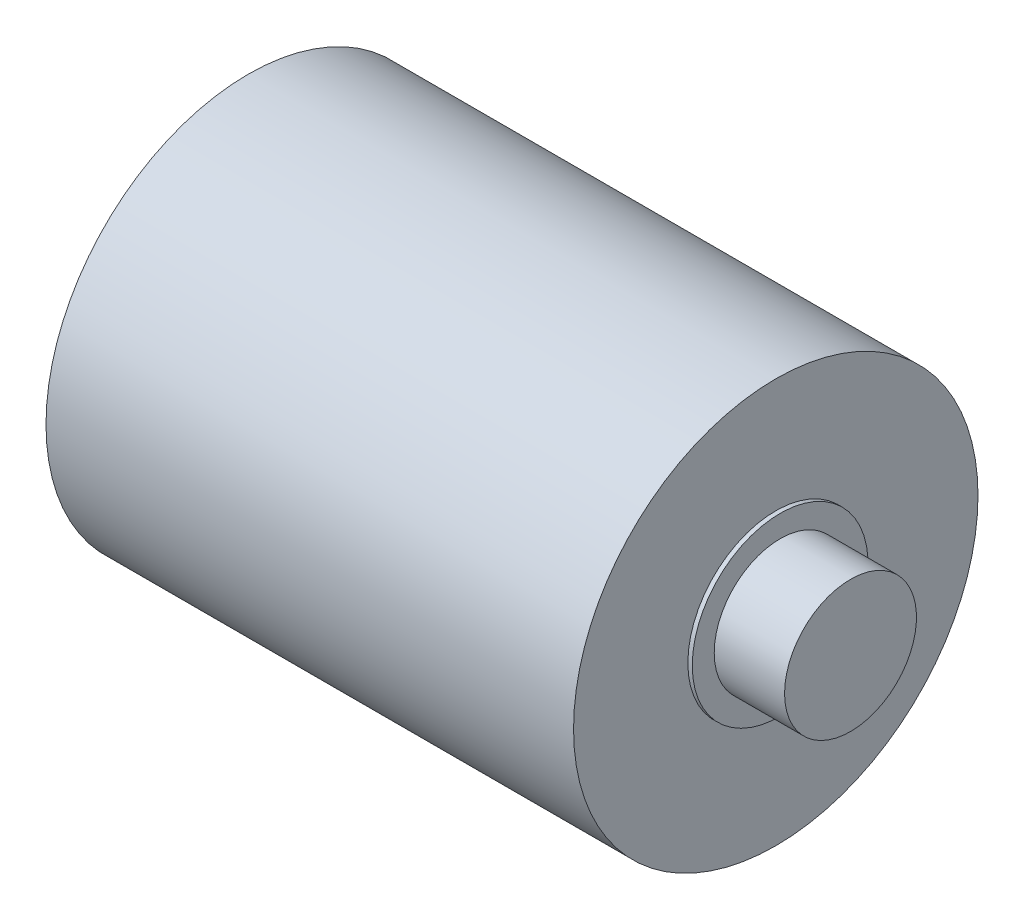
ISO-10303-21;
HEADER;
FILE_DESCRIPTION(('STEP AP214'),'2;1');
FILE_NAME('part.step','',(''),(''),'','','');
FILE_SCHEMA(('AUTOMOTIVE_DESIGN { 1 0 10303 214 1 1 1 1 }'));
ENDSEC;
DATA;
#1=APPLICATION_CONTEXT('core data for automotive mechanical design processes');
#2=APPLICATION_PROTOCOL_DEFINITION('international standard','automotive_design',2000,#1);
#3=PRODUCT_CONTEXT('',#1,'mechanical');
#4=PRODUCT('Part','Part','',(#3));
#5=PRODUCT_RELATED_PRODUCT_CATEGORY('part','',(#4));
#6=PRODUCT_DEFINITION_FORMATION('','',#4);
#7=PRODUCT_DEFINITION_CONTEXT('part definition',#1,'design');
#8=PRODUCT_DEFINITION('design','',#6,#7);
#9=PRODUCT_DEFINITION_SHAPE('','',#8);
#10=(LENGTH_UNIT() NAMED_UNIT(*) SI_UNIT(.MILLI.,.METRE.));
#11=(NAMED_UNIT(*) PLANE_ANGLE_UNIT() SI_UNIT($,.RADIAN.));
#12=(NAMED_UNIT(*) SI_UNIT($,.STERADIAN.) SOLID_ANGLE_UNIT());
#13=UNCERTAINTY_MEASURE_WITH_UNIT(LENGTH_MEASURE(1.E-05),#10,'distance_accuracy_value','');
#14=(GEOMETRIC_REPRESENTATION_CONTEXT(3) GLOBAL_UNCERTAINTY_ASSIGNED_CONTEXT((#13)) GLOBAL_UNIT_ASSIGNED_CONTEXT((#10,
#11,#12)) REPRESENTATION_CONTEXT('',''));
#15=CARTESIAN_POINT('',(0.,0.,0.));
#16=DIRECTION('',(0.,0.,1.));
#17=DIRECTION('',(1.,0.,0.));
#18=AXIS2_PLACEMENT_3D('',#15,#16,#17);
#19=CARTESIAN_POINT('',(68.5,0.,0.));
#20=DIRECTION('',(1.,0.,0.));
#21=DIRECTION('',(0.,0.,-1.));
#22=AXIS2_PLACEMENT_3D('',#19,#20,#21);
#23=PLANE('',#22);
#24=CARTESIAN_POINT('',(68.5,0.,0.));
#25=DIRECTION('',(-1.,0.,0.));
#26=DIRECTION('',(0.,0.,1.));
#27=AXIS2_PLACEMENT_3D('',#24,#25,#26);
#28=CIRCLE('',#27,7.5);
#29=CARTESIAN_POINT('',(68.5,0.,7.5));
#30=VERTEX_POINT('',#29);
#31=EDGE_CURVE('E18',#30,#30,#28,.T.);
#32=ORIENTED_EDGE('',*,*,#31,.F.);
#33=EDGE_LOOP('',(#32));
#34=FACE_BOUND('',#33,.T.);
#35=ADVANCED_FACE('F15',(#34),#23,.T.);
#36=CARTESIAN_POINT('',(-8.5,0.,0.));
#37=DIRECTION('',(-1.,0.,0.));
#38=DIRECTION('',(0.,0.,1.));
#39=AXIS2_PLACEMENT_3D('',#36,#37,#38);
#40=PLANE('',#39);
#41=CARTESIAN_POINT('',(-8.5,0.,0.));
#42=DIRECTION('',(1.,0.,0.));
#43=DIRECTION('',(0.,0.,-1.));
#44=AXIS2_PLACEMENT_3D('',#41,#42,#43);
#45=CIRCLE('',#44,7.5);
#46=CARTESIAN_POINT('',(-8.5,0.,-7.5));
#47=VERTEX_POINT('',#46);
#48=EDGE_CURVE('E46',#47,#47,#45,.T.);
#49=ORIENTED_EDGE('',*,*,#48,.F.);
#50=EDGE_LOOP('',(#49));
#51=FACE_BOUND('',#50,.T.);
#52=ADVANCED_FACE('F56',(#51),#40,.T.);
#53=CARTESIAN_POINT('',(68.5,0.,0.));
#54=DIRECTION('',(-1.,0.,0.));
#55=DIRECTION('',(0.,0.,1.));
#56=AXIS2_PLACEMENT_3D('',#53,#54,#55);
#57=CYLINDRICAL_SURFACE('',#56,7.5);
#58=CARTESIAN_POINT('',(60.5,0.,0.));
#59=DIRECTION('',(-1.,0.,0.));
#60=DIRECTION('',(0.,0.,1.));
#61=AXIS2_PLACEMENT_3D('',#58,#59,#60);
#62=CIRCLE('',#61,7.5);
#63=CARTESIAN_POINT('',(60.5,0.,7.5));
#64=VERTEX_POINT('',#63);
#65=EDGE_CURVE('E44',#64,#64,#62,.T.);
#66=ORIENTED_EDGE('',*,*,#65,.F.);
#67=EDGE_LOOP('',(#66));
#68=FACE_BOUND('',#67,.T.);
#69=ORIENTED_EDGE('',*,*,#31,.T.);
#70=EDGE_LOOP('',(#69));
#71=FACE_BOUND('',#70,.T.);
#72=ADVANCED_FACE('F53',(#68,#71),#57,.T.);
#73=CARTESIAN_POINT('',(-8.5,0.,0.));
#74=DIRECTION('',(1.,0.,0.));
#75=DIRECTION('',(0.,0.,-1.));
#76=AXIS2_PLACEMENT_3D('',#73,#74,#75);
#77=CYLINDRICAL_SURFACE('',#76,7.5);
#78=CARTESIAN_POINT('',(-0.5,0.,0.));
#79=DIRECTION('',(1.,0.,0.));
#80=DIRECTION('',(0.,0.,-1.));
#81=AXIS2_PLACEMENT_3D('',#78,#79,#80);
#82=CIRCLE('',#81,7.5);
#83=CARTESIAN_POINT('',(-0.5,0.,-7.5));
#84=VERTEX_POINT('',#83);
#85=EDGE_CURVE('E41',#84,#84,#82,.T.);
#86=ORIENTED_EDGE('',*,*,#85,.F.);
#87=EDGE_LOOP('',(#86));
#88=FACE_BOUND('',#87,.T.);
#89=ORIENTED_EDGE('',*,*,#48,.T.);
#90=EDGE_LOOP('',(#89));
#91=FACE_BOUND('',#90,.T.);
#92=ADVANCED_FACE('F92',(#88,#91),#77,.T.);
#93=CARTESIAN_POINT('',(60.5,0.,0.));
#94=DIRECTION('',(1.,0.,0.));
#95=DIRECTION('',(0.,0.,-1.));
#96=AXIS2_PLACEMENT_3D('',#93,#94,#95);
#97=PLANE('',#96);
#98=ORIENTED_EDGE('',*,*,#65,.T.);
#99=EDGE_LOOP('',(#98));
#100=FACE_BOUND('',#99,.T.);
#101=CARTESIAN_POINT('',(60.5,0.,0.));
#102=DIRECTION('',(-1.,0.,0.));
#103=DIRECTION('',(0.,0.,1.));
#104=AXIS2_PLACEMENT_3D('',#101,#102,#103);
#105=CIRCLE('',#104,10.);
#106=CARTESIAN_POINT('',(60.5,0.,10.));
#107=VERTEX_POINT('',#106);
#108=EDGE_CURVE('E38',#107,#107,#105,.T.);
#109=ORIENTED_EDGE('',*,*,#108,.F.);
#110=EDGE_LOOP('',(#109));
#111=FACE_BOUND('',#110,.T.);
#112=ADVANCED_FACE('F88',(#100,#111),#97,.T.);
#113=CARTESIAN_POINT('',(-0.5,0.,0.));
#114=DIRECTION('',(-1.,0.,0.));
#115=DIRECTION('',(0.,0.,1.));
#116=AXIS2_PLACEMENT_3D('',#113,#114,#115);
#117=PLANE('',#116);
#118=ORIENTED_EDGE('',*,*,#85,.T.);
#119=EDGE_LOOP('',(#118));
#120=FACE_BOUND('',#119,.T.);
#121=CARTESIAN_POINT('',(-0.5,0.,0.));
#122=DIRECTION('',(1.,0.,0.));
#123=DIRECTION('',(0.,0.,-1.));
#124=AXIS2_PLACEMENT_3D('',#121,#122,#123);
#125=CIRCLE('',#124,10.);
#126=CARTESIAN_POINT('',(-0.5,0.,-10.));
#127=VERTEX_POINT('',#126);
#128=EDGE_CURVE('E35',#127,#127,#125,.T.);
#129=ORIENTED_EDGE('',*,*,#128,.F.);
#130=EDGE_LOOP('',(#129));
#131=FACE_BOUND('',#130,.T.);
#132=ADVANCED_FACE('F84',(#120,#131),#117,.T.);
#133=CARTESIAN_POINT('',(60.5,0.,0.));
#134=DIRECTION('',(-1.,0.,0.));
#135=DIRECTION('',(0.,0.,1.));
#136=AXIS2_PLACEMENT_3D('',#133,#134,#135);
#137=CYLINDRICAL_SURFACE('',#136,10.);
#138=CARTESIAN_POINT('',(60.,0.,0.));
#139=DIRECTION('',(-1.,0.,0.));
#140=DIRECTION('',(0.,0.,1.));
#141=AXIS2_PLACEMENT_3D('',#138,#139,#140);
#142=CIRCLE('',#141,10.);
#143=CARTESIAN_POINT('',(60.,0.,10.));
#144=VERTEX_POINT('',#143);
#145=EDGE_CURVE('E32',#144,#144,#142,.T.);
#146=ORIENTED_EDGE('',*,*,#145,.F.);
#147=EDGE_LOOP('',(#146));
#148=FACE_BOUND('',#147,.T.);
#149=ORIENTED_EDGE('',*,*,#108,.T.);
#150=EDGE_LOOP('',(#149));
#151=FACE_BOUND('',#150,.T.);
#152=ADVANCED_FACE('F80',(#148,#151),#137,.T.);
#153=CARTESIAN_POINT('',(-0.5,0.,0.));
#154=DIRECTION('',(1.,0.,0.));
#155=DIRECTION('',(0.,0.,-1.));
#156=AXIS2_PLACEMENT_3D('',#153,#154,#155);
#157=CYLINDRICAL_SURFACE('',#156,10.);
#158=ORIENTED_EDGE('',*,*,#128,.T.);
#159=EDGE_LOOP('',(#158));
#160=FACE_BOUND('',#159,.T.);
#161=CARTESIAN_POINT('',(0.,0.,0.));
#162=DIRECTION('',(1.,0.,0.));
#163=DIRECTION('',(0.,0.,-1.));
#164=AXIS2_PLACEMENT_3D('',#161,#162,#163);
#165=CIRCLE('',#164,10.);
#166=CARTESIAN_POINT('',(0.,0.,-10.));
#167=VERTEX_POINT('',#166);
#168=EDGE_CURVE('E27',#167,#167,#165,.F.);
#169=ORIENTED_EDGE('',*,*,#168,.T.);
#170=EDGE_LOOP('',(#169));
#171=FACE_BOUND('',#170,.T.);
#172=ADVANCED_FACE('F76',(#160,#171),#157,.T.);
#173=CARTESIAN_POINT('',(60.,0.,0.));
#174=DIRECTION('',(1.,0.,0.));
#175=DIRECTION('',(0.,0.,-1.));
#176=AXIS2_PLACEMENT_3D('',#173,#174,#175);
#177=PLANE('',#176);
#178=ORIENTED_EDGE('',*,*,#145,.T.);
#179=EDGE_LOOP('',(#178));
#180=FACE_BOUND('',#179,.T.);
#181=CARTESIAN_POINT('',(60.,0.,0.));
#182=DIRECTION('',(-1.,0.,0.));
#183=DIRECTION('',(0.,0.,1.));
#184=AXIS2_PLACEMENT_3D('',#181,#182,#183);
#185=CIRCLE('',#184,23.);
#186=CARTESIAN_POINT('',(60.,0.,23.));
#187=VERTEX_POINT('',#186);
#188=EDGE_CURVE('E22',#187,#187,#185,.T.);
#189=ORIENTED_EDGE('',*,*,#188,.F.);
#190=EDGE_LOOP('',(#189));
#191=FACE_BOUND('',#190,.T.);
#192=ADVANCED_FACE('F69',(#180,#191),#177,.T.);
#193=CARTESIAN_POINT('',(0.,0.,0.));
#194=DIRECTION('',(1.,0.,0.));
#195=DIRECTION('',(0.,0.,-1.));
#196=AXIS2_PLACEMENT_3D('',#193,#194,#195);
#197=PLANE('',#196);
#198=ORIENTED_EDGE('',*,*,#168,.F.);
#199=EDGE_LOOP('',(#198));
#200=FACE_BOUND('',#199,.T.);
#201=CARTESIAN_POINT('',(0.,0.,0.));
#202=DIRECTION('',(-1.,0.,0.));
#203=DIRECTION('',(0.,0.,1.));
#204=AXIS2_PLACEMENT_3D('',#201,#202,#203);
#205=CIRCLE('',#204,23.);
#206=CARTESIAN_POINT('',(0.,0.,23.));
#207=VERTEX_POINT('',#206);
#208=EDGE_CURVE('E10',#207,#207,#205,.F.);
#209=ORIENTED_EDGE('',*,*,#208,.F.);
#210=EDGE_LOOP('',(#209));
#211=FACE_BOUND('',#210,.T.);
#212=ADVANCED_FACE('F64',(#200,#211),#197,.F.);
#213=CARTESIAN_POINT('',(60.,0.,0.));
#214=DIRECTION('',(-1.,0.,0.));
#215=DIRECTION('',(0.,0.,1.));
#216=AXIS2_PLACEMENT_3D('',#213,#214,#215);
#217=CYLINDRICAL_SURFACE('',#216,23.);
#218=ORIENTED_EDGE('',*,*,#208,.T.);
#219=EDGE_LOOP('',(#218));
#220=FACE_BOUND('',#219,.T.);
#221=ORIENTED_EDGE('',*,*,#188,.T.);
#222=EDGE_LOOP('',(#221));
#223=FACE_BOUND('',#222,.T.);
#224=ADVANCED_FACE('F62',(#220,#223),#217,.T.);
#225=CLOSED_SHELL('',(#35,#52,#72,#92,#112,#132,#152,#172,#192,#212,#224));
#226=MANIFOLD_SOLID_BREP('B1',#225);
#227=ADVANCED_BREP_SHAPE_REPRESENTATION('',(#18,#226),#14);
#228=SHAPE_DEFINITION_REPRESENTATION(#9,#227);
ENDSEC;
END-ISO-10303-21;
